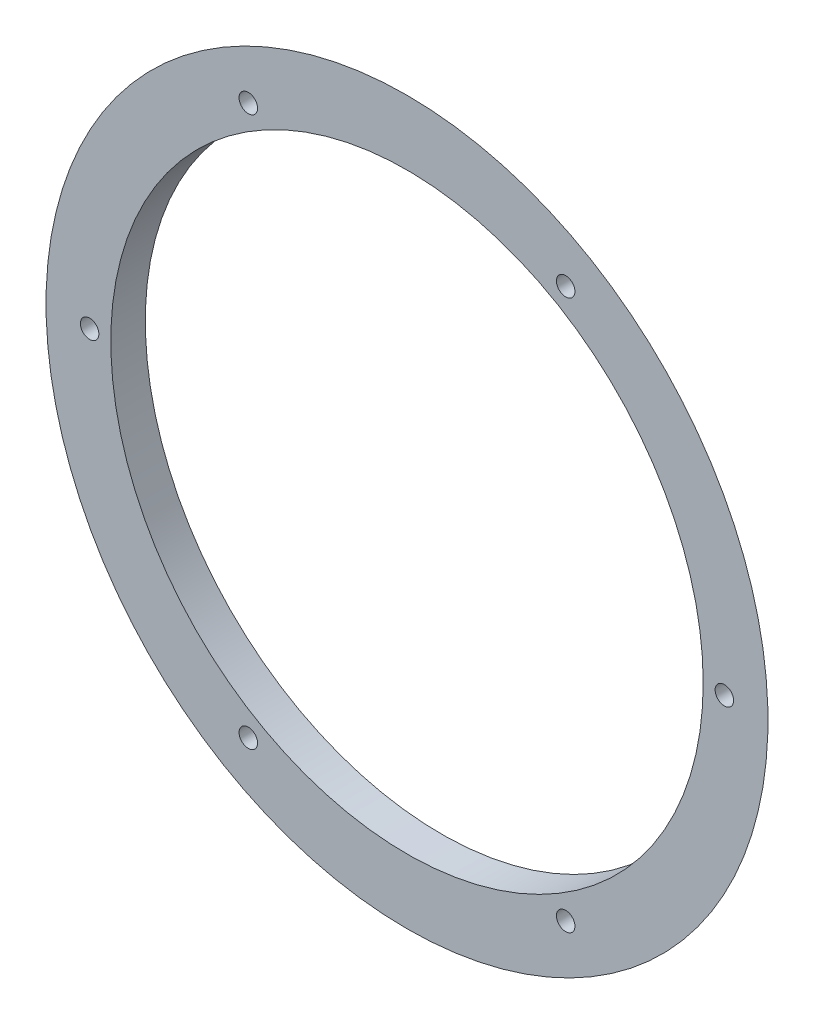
from build123d import *

# Parameters (mm, degrees)
SKETCH1_R              = 99.6696
SKETCH1_R_2            = 81.788
BOSS_EXTRUDE1_DEPTH    = 9.525
F_10_CLEARANCE_HOLE1_D = 5.1054


with BuildPart() as part:
    # Sketch1 → Boss-Extrude1 (new body)
    with BuildSketch(Plane.XY):
        Circle(SKETCH1_R)
        Circle(SKETCH1_R_2, mode=Mode.SUBTRACT)
    extrude(amount=-BOSS_EXTRUDE1_DEPTH)

    # 10 Clearance Hole1 (through all)
    with Locations(Plane.XY):
        with Locations((-87.63, 0), (-43.815, 75.889806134), (43.815, 75.889806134), (87.63, 0), (43.815, -75.889806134), (-43.815, -75.889806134)):
            Hole(F_10_CLEARANCE_HOLE1_D / 2)

    # Sketch4 → Cut-Revolve1 (revolve, cut)
    with BuildSketch(Plane(origin=(0, 0, 0), x_dir=(0, 0, -1), z_dir=(1, 0, 0))):
        with BuildLine():
            Line((9.525, 83.068649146), (25.062626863, 83.068649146))
            Line((25.062626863, 83.068649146), (25.062626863, 117.364761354))
            Line((25.062626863, 117.364761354), (0, 117.364761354))
            Line((0, 117.364761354), (0, 99.6696))
            ThreePointArc((0, 99.6696), (4.978679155, 91.493160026), (9.525, 83.068649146))
        make_face()
    revolve(axis=Axis((0, 0, 0), (0, 0, 1)), mode=Mode.SUBTRACT)


solid = part.part
